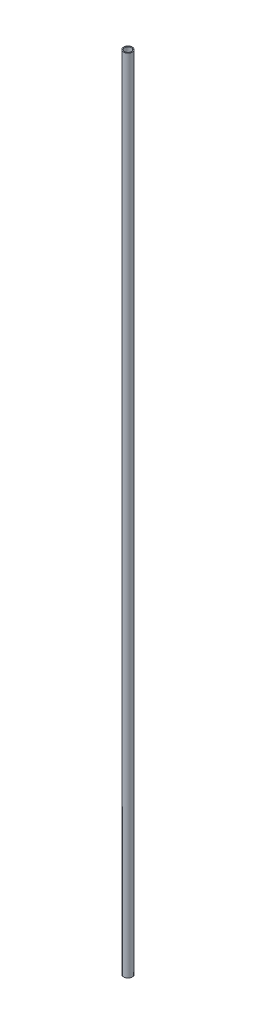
from build123d import *

# Parameters (mm, degrees)
SKETCH1_R           = 16.7005
SKETCH1_R_2         = 13.0683
BOSS_EXTRUDE1_DEPTH = 3048


with BuildPart() as part:
    # Sketch1 → Boss-Extrude1 (new body)
    with BuildSketch(Plane(origin=(0, 0, 0), x_dir=(1, 0, 0), z_dir=(0, 1, 0))):
        with Locations(Location((0, 0, 0), (0, 0, 270))):
            Circle(SKETCH1_R)
        with Locations(Location((0, 0, 0), (0, 0, 270))):
            Circle(SKETCH1_R_2, mode=Mode.SUBTRACT)
    extrude(amount=BOSS_EXTRUDE1_DEPTH)


solid = part.part
